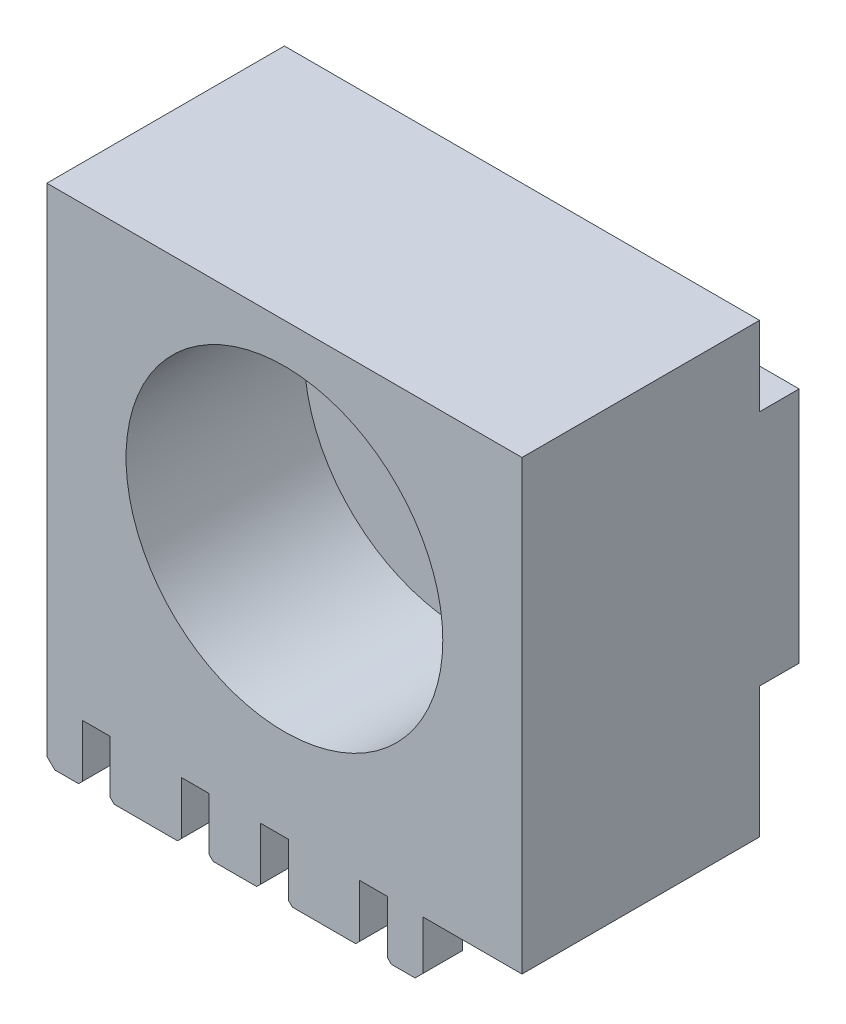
from build123d import *

# Parameters (mm, degrees)
SKETCH_1_R          = 2.25
EXTRUDE_1_DEPTH     = 7
SKETCH_2_OUTSIDE_W  = 12.77
SKETCH_2_OUTSIDE_H  = 18.505
CUT_EXTRUDE_1_DEPTH = 19.846225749
SKETCH_3_R          = 4
CUT_EXTRUDE_2_DEPTH = 4.5


with BuildPart() as part:
    # Sketch 1 → Extrude 1 (new body)
    with BuildSketch(Plane.XY):
        Polygon((0, 12.735), (12, 12.735), (12, 1.435), (9.5, 1.435), (9.5, 0.2), (9.3, 0), (8.7, 0), (8.6, 0.1), (8.6, 1.435), (7.9, 1.435), (7.9, 0.1), (7.8, 0), (6.2, 0), (6.1, 0.1), (6.1, 1.435), (5.4, 1.435), (5.4, 0.1), (5.3, 0), (4.2, 0), (4.1, 0.1), (4.1, 1.435), (3.4, 1.435), (3.4, 0.1), (3.3, 0), (1.7, 0), (1.6, 0.1), (1.6, 1.435), (0.9, 1.435), (0.9, 0.1), (0.8, 0), (0.2, 0), (0, 0.2), align=None)
        with Locations((6, 7.735)):
            Circle(SKETCH_1_R, mode=Mode.SUBTRACT)
    extrude(amount=EXTRUDE_1_DEPTH)

    # Sketch 2 outside → Cut-Extrude 1 (cut, through all)
    with BuildSketch(Plane(origin=(12, 0, 0), x_dir=(0, 0, -1), z_dir=(1, 0, 0))):
        with Locations((-3.5, 6.3675)):
            Rectangle(SKETCH_2_OUTSIDE_W, SKETCH_2_OUTSIDE_H)
        Polygon((-7, 12.735), (-1, 12.735), (-1, 10.735), (0, 10.735), (0, 4.735), (-1, 4.735), (-1, 1.435), (-6, 1.435), (-6, 0), (-7, 0), align=None, mode=Mode.SUBTRACT)
    extrude(amount=-CUT_EXTRUDE_1_DEPTH, mode=Mode.SUBTRACT)

    # Sketch 3 → Cut-Extrude 2 (cut)
    with BuildSketch(Plane.XY.offset(7)):
        with Locations((6, 7.735)):
            Circle(SKETCH_3_R)
    extrude(amount=-CUT_EXTRUDE_2_DEPTH, mode=Mode.SUBTRACT)


solid = part.part
